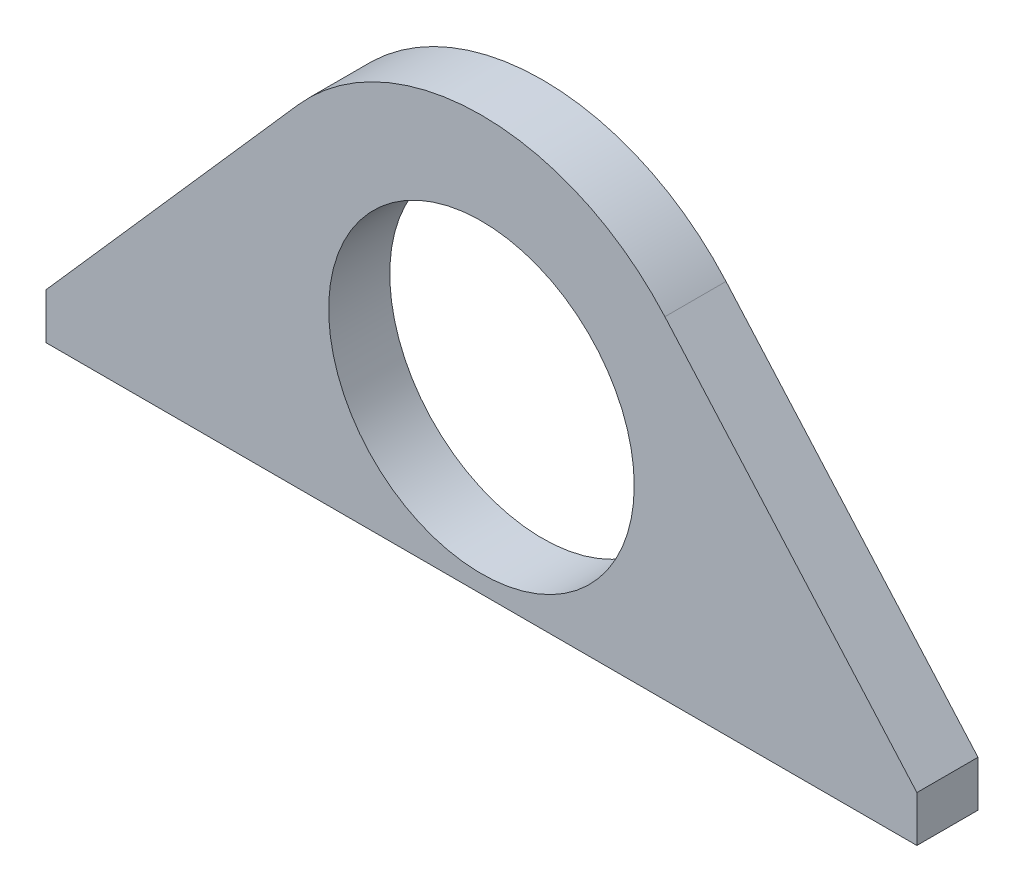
from build123d import *

# Parameters (mm, degrees)
ESQUISSE1_R      = 20
EXTRUSION1_DEPTH = 8


with BuildPart() as part:
    # Esquisse1 → Extrusion1 (new body)
    with BuildSketch(Plane.XY):
        with BuildLine():
            Line((-57, -22.3), (-57, -16.3))
            Line((-57, -16.3), (-24.013325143, 21.150891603))
            ThreePointArc((-24.013325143, 21.150891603), (-13.175193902, 29.161863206), (0, 32))
            ThreePointArc((0, 32), (13.175193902, 29.161863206), (24.013325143, 21.150891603))
            Line((24.013325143, 21.150891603), (57, -16.3))
            Line((57, -16.3), (57, -22.3))
            Line((57, -22.3), (-57, -22.3))
        make_face()
        Circle(ESQUISSE1_R, mode=Mode.SUBTRACT)
    extrude(amount=EXTRUSION1_DEPTH)


solid = part.part
